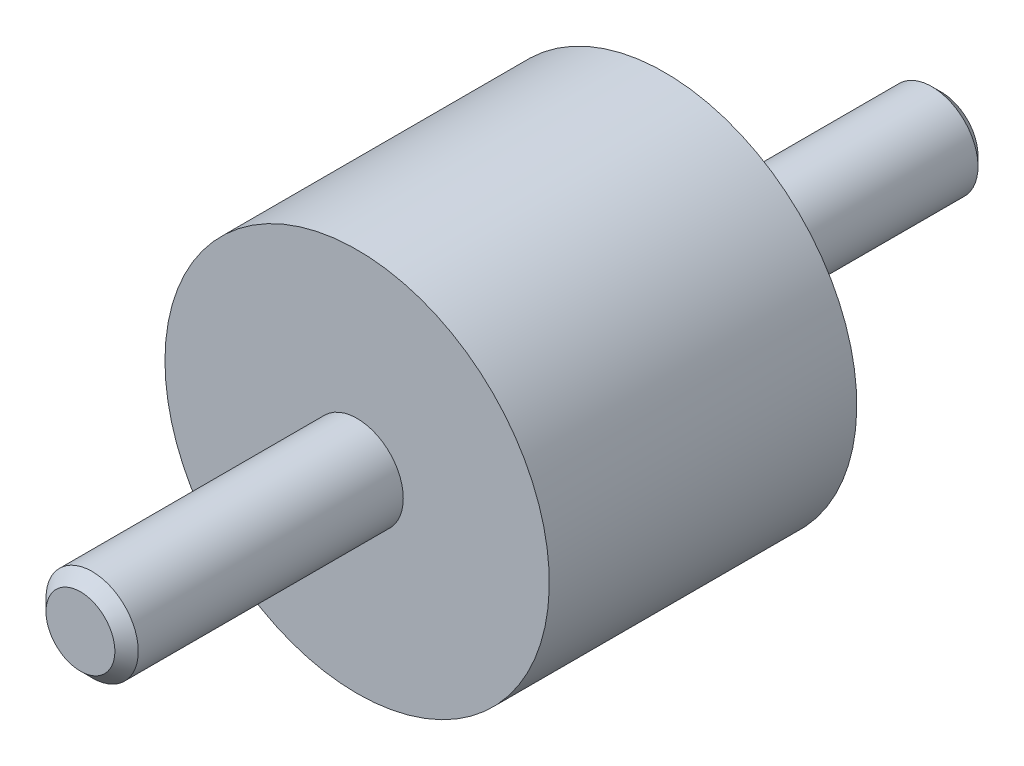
ISO-10303-21;
HEADER;
FILE_DESCRIPTION(('STEP AP214'),'2;1');
FILE_NAME('part.step','',(''),(''),'','','');
FILE_SCHEMA(('AUTOMOTIVE_DESIGN { 1 0 10303 214 1 1 1 1 }'));
ENDSEC;
DATA;
#1=APPLICATION_CONTEXT('core data for automotive mechanical design processes');
#2=APPLICATION_PROTOCOL_DEFINITION('international standard','automotive_design',2000,#1);
#3=PRODUCT_CONTEXT('',#1,'mechanical');
#4=PRODUCT('Part','Part','',(#3));
#5=PRODUCT_RELATED_PRODUCT_CATEGORY('part','',(#4));
#6=PRODUCT_DEFINITION_FORMATION('','',#4);
#7=PRODUCT_DEFINITION_CONTEXT('part definition',#1,'design');
#8=PRODUCT_DEFINITION('design','',#6,#7);
#9=PRODUCT_DEFINITION_SHAPE('','',#8);
#10=(LENGTH_UNIT() NAMED_UNIT(*) SI_UNIT(.MILLI.,.METRE.));
#11=(NAMED_UNIT(*) PLANE_ANGLE_UNIT() SI_UNIT($,.RADIAN.));
#12=(NAMED_UNIT(*) SI_UNIT($,.STERADIAN.) SOLID_ANGLE_UNIT());
#13=UNCERTAINTY_MEASURE_WITH_UNIT(LENGTH_MEASURE(1.E-05),#10,'distance_accuracy_value','');
#14=(GEOMETRIC_REPRESENTATION_CONTEXT(3) GLOBAL_UNCERTAINTY_ASSIGNED_CONTEXT((#13)) GLOBAL_UNIT_ASSIGNED_CONTEXT((#10,
#11,#12)) REPRESENTATION_CONTEXT('',''));
#15=CARTESIAN_POINT('',(0.,0.,0.));
#16=DIRECTION('',(0.,0.,1.));
#17=DIRECTION('',(1.,0.,0.));
#18=AXIS2_PLACEMENT_3D('',#15,#16,#17);
#19=CARTESIAN_POINT('',(0.,0.,0.5));
#20=DIRECTION('',(0.,0.,1.));
#21=DIRECTION('',(0.,-1.,0.));
#22=AXIS2_PLACEMENT_3D('',#19,#20,#21);
#23=CYLINDRICAL_SURFACE('',#22,12.5);
#24=CARTESIAN_POINT('',(0.,0.,0.));
#25=DIRECTION('',(0.,0.,1.));
#26=DIRECTION('',(0.,-1.,0.));
#27=AXIS2_PLACEMENT_3D('',#24,#25,#26);
#28=CIRCLE('',#27,12.5);
#29=CARTESIAN_POINT('',(0.,-12.5,0.));
#30=VERTEX_POINT('',#29);
#31=EDGE_CURVE('E22',#30,#30,#28,.T.);
#32=ORIENTED_EDGE('',*,*,#31,.T.);
#33=EDGE_LOOP('',(#32));
#34=FACE_BOUND('',#33,.T.);
#35=CARTESIAN_POINT('',(0.,0.,20.));
#36=DIRECTION('',(0.,0.,-1.));
#37=DIRECTION('',(-1.,0.,0.));
#38=AXIS2_PLACEMENT_3D('',#35,#36,#37);
#39=CIRCLE('',#38,12.5);
#40=CARTESIAN_POINT('',(-12.5,0.,20.));
#41=VERTEX_POINT('',#40);
#42=EDGE_CURVE('E34',#41,#41,#39,.T.);
#43=ORIENTED_EDGE('',*,*,#42,.T.);
#44=EDGE_LOOP('',(#43));
#45=FACE_BOUND('',#44,.T.);
#46=ADVANCED_FACE('F12',(#34,#45),#23,.T.);
#47=CARTESIAN_POINT('',(12.5,0.,0.));
#48=DIRECTION('',(0.,0.,-1.));
#49=DIRECTION('',(0.,1.,0.));
#50=AXIS2_PLACEMENT_3D('',#47,#48,#49);
#51=PLANE('',#50);
#52=CARTESIAN_POINT('',(0.,0.,0.));
#53=DIRECTION('',(0.,0.,-1.));
#54=DIRECTION('',(0.,1.,0.));
#55=AXIS2_PLACEMENT_3D('',#52,#53,#54);
#56=CIRCLE('',#55,3.);
#57=CARTESIAN_POINT('',(0.,3.,0.));
#58=VERTEX_POINT('',#57);
#59=EDGE_CURVE('E18',#58,#58,#56,.T.);
#60=ORIENTED_EDGE('',*,*,#59,.F.);
#61=EDGE_LOOP('',(#60));
#62=FACE_BOUND('',#61,.T.);
#63=ORIENTED_EDGE('',*,*,#31,.F.);
#64=EDGE_LOOP('',(#63));
#65=FACE_BOUND('',#64,.T.);
#66=ADVANCED_FACE('F57',(#62,#65),#51,.T.);
#67=CARTESIAN_POINT('',(0.,0.,-18.));
#68=DIRECTION('',(0.,0.,1.));
#69=DIRECTION('',(0.,-1.,0.));
#70=AXIS2_PLACEMENT_3D('',#67,#68,#69);
#71=CYLINDRICAL_SURFACE('',#70,3.);
#72=CARTESIAN_POINT('',(0.,0.,-17.3865));
#73=DIRECTION('',(0.,0.,1.));
#74=DIRECTION('',(0.,-1.,0.));
#75=AXIS2_PLACEMENT_3D('',#72,#73,#74);
#76=CIRCLE('',#75,3.);
#77=CARTESIAN_POINT('',(0.,-3.,-17.3865));
#78=VERTEX_POINT('',#77);
#79=EDGE_CURVE('E26',#78,#78,#76,.T.);
#80=ORIENTED_EDGE('',*,*,#79,.T.);
#81=EDGE_LOOP('',(#80));
#82=FACE_BOUND('',#81,.T.);
#83=ORIENTED_EDGE('',*,*,#59,.T.);
#84=EDGE_LOOP('',(#83));
#85=FACE_BOUND('',#84,.T.);
#86=ADVANCED_FACE('F62',(#82,#85),#71,.T.);
#87=CARTESIAN_POINT('',(0.,0.,-17.3865));
#88=DIRECTION('',(0.,0.,1.));
#89=DIRECTION('',(0.,-1.,0.));
#90=AXIS2_PLACEMENT_3D('',#87,#88,#89);
#91=CONICAL_SURFACE('',#90,3.,0.785398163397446);
#92=CARTESIAN_POINT('',(0.,0.,-18.));
#93=DIRECTION('',(0.,0.,1.));
#94=DIRECTION('',(0.,-1.,0.));
#95=AXIS2_PLACEMENT_3D('',#92,#93,#94);
#96=CIRCLE('',#95,2.3865);
#97=CARTESIAN_POINT('',(0.,-2.3865,-18.));
#98=VERTEX_POINT('',#97);
#99=EDGE_CURVE('E31',#98,#98,#96,.T.);
#100=ORIENTED_EDGE('',*,*,#99,.T.);
#101=EDGE_LOOP('',(#100));
#102=FACE_BOUND('',#101,.T.);
#103=ORIENTED_EDGE('',*,*,#79,.F.);
#104=EDGE_LOOP('',(#103));
#105=FACE_BOUND('',#104,.T.);
#106=ADVANCED_FACE('F78',(#102,#105),#91,.T.);
#107=CARTESIAN_POINT('',(2.3865,0.,-18.));
#108=DIRECTION('',(0.,0.,-1.));
#109=DIRECTION('',(0.,1.,0.));
#110=AXIS2_PLACEMENT_3D('',#107,#108,#109);
#111=PLANE('',#110);
#112=ORIENTED_EDGE('',*,*,#99,.F.);
#113=EDGE_LOOP('',(#112));
#114=FACE_BOUND('',#113,.T.);
#115=ADVANCED_FACE('F70',(#114),#111,.T.);
#116=CARTESIAN_POINT('',(0.,12.5,20.));
#117=DIRECTION('',(0.,0.,1.));
#118=DIRECTION('',(1.,0.,0.));
#119=AXIS2_PLACEMENT_3D('',#116,#117,#118);
#120=PLANE('',#119);
#121=CARTESIAN_POINT('',(0.,0.,20.));
#122=DIRECTION('',(0.,0.,1.));
#123=DIRECTION('',(1.,0.,0.));
#124=AXIS2_PLACEMENT_3D('',#121,#122,#123);
#125=CIRCLE('',#124,3.);
#126=CARTESIAN_POINT('',(3.,0.,20.));
#127=VERTEX_POINT('',#126);
#128=EDGE_CURVE('E8',#127,#127,#125,.F.);
#129=ORIENTED_EDGE('',*,*,#128,.T.);
#130=EDGE_LOOP('',(#129));
#131=FACE_BOUND('',#130,.T.);
#132=ORIENTED_EDGE('',*,*,#42,.F.);
#133=EDGE_LOOP('',(#132));
#134=FACE_BOUND('',#133,.T.);
#135=ADVANCED_FACE('F68',(#131,#134),#120,.T.);
#136=CARTESIAN_POINT('',(0.,0.,15.));
#137=DIRECTION('',(0.,0.,1.));
#138=DIRECTION('',(0.,-1.,0.));
#139=AXIS2_PLACEMENT_3D('',#136,#137,#138);
#140=CYLINDRICAL_SURFACE('',#139,3.);
#141=ORIENTED_EDGE('',*,*,#128,.F.);
#142=EDGE_LOOP('',(#141));
#143=FACE_BOUND('',#142,.T.);
#144=CARTESIAN_POINT('',(0.,0.,37.2385265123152));
#145=DIRECTION('',(0.,0.,-1.));
#146=DIRECTION('',(-1.,0.,0.));
#147=AXIS2_PLACEMENT_3D('',#144,#145,#146);
#148=CIRCLE('',#147,3.);
#149=CARTESIAN_POINT('',(-3.,0.,37.2385265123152));
#150=VERTEX_POINT('',#149);
#151=EDGE_CURVE('E37',#150,#150,#148,.T.);
#152=ORIENTED_EDGE('',*,*,#151,.T.);
#153=EDGE_LOOP('',(#152));
#154=FACE_BOUND('',#153,.T.);
#155=ADVANCED_FACE('F54',(#143,#154),#140,.T.);
#156=CARTESIAN_POINT('',(0.,0.,37.2385265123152));
#157=DIRECTION('',(0.,0.,-1.));
#158=DIRECTION('',(-1.,0.,0.));
#159=AXIS2_PLACEMENT_3D('',#156,#157,#158);
#160=CONICAL_SURFACE('',#159,3.,0.785398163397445);
#161=CARTESIAN_POINT('',(0.,0.,38.));
#162=DIRECTION('',(0.,0.,-1.));
#163=DIRECTION('',(-1.,0.,0.));
#164=AXIS2_PLACEMENT_3D('',#161,#162,#163);
#165=CIRCLE('',#164,2.23852651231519);
#166=CARTESIAN_POINT('',(-2.23852651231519,0.,38.));
#167=VERTEX_POINT('',#166);
#168=EDGE_CURVE('E40',#167,#167,#165,.T.);
#169=ORIENTED_EDGE('',*,*,#168,.T.);
#170=EDGE_LOOP('',(#169));
#171=FACE_BOUND('',#170,.T.);
#172=ORIENTED_EDGE('',*,*,#151,.F.);
#173=EDGE_LOOP('',(#172));
#174=FACE_BOUND('',#173,.T.);
#175=ADVANCED_FACE('F44',(#171,#174),#160,.T.);
#176=CARTESIAN_POINT('',(0.,2.23852651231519,38.));
#177=DIRECTION('',(0.,0.,1.));
#178=DIRECTION('',(1.,0.,0.));
#179=AXIS2_PLACEMENT_3D('',#176,#177,#178);
#180=PLANE('',#179);
#181=ORIENTED_EDGE('',*,*,#168,.F.);
#182=EDGE_LOOP('',(#181));
#183=FACE_BOUND('',#182,.T.);
#184=ADVANCED_FACE('F47',(#183),#180,.T.);
#185=CLOSED_SHELL('',(#46,#66,#86,#106,#115,#135,#155,#175,#184));
#186=MANIFOLD_SOLID_BREP('B1',#185);
#187=ADVANCED_BREP_SHAPE_REPRESENTATION('',(#18,#186),#14);
#188=SHAPE_DEFINITION_REPRESENTATION(#9,#187);
ENDSEC;
END-ISO-10303-21;
